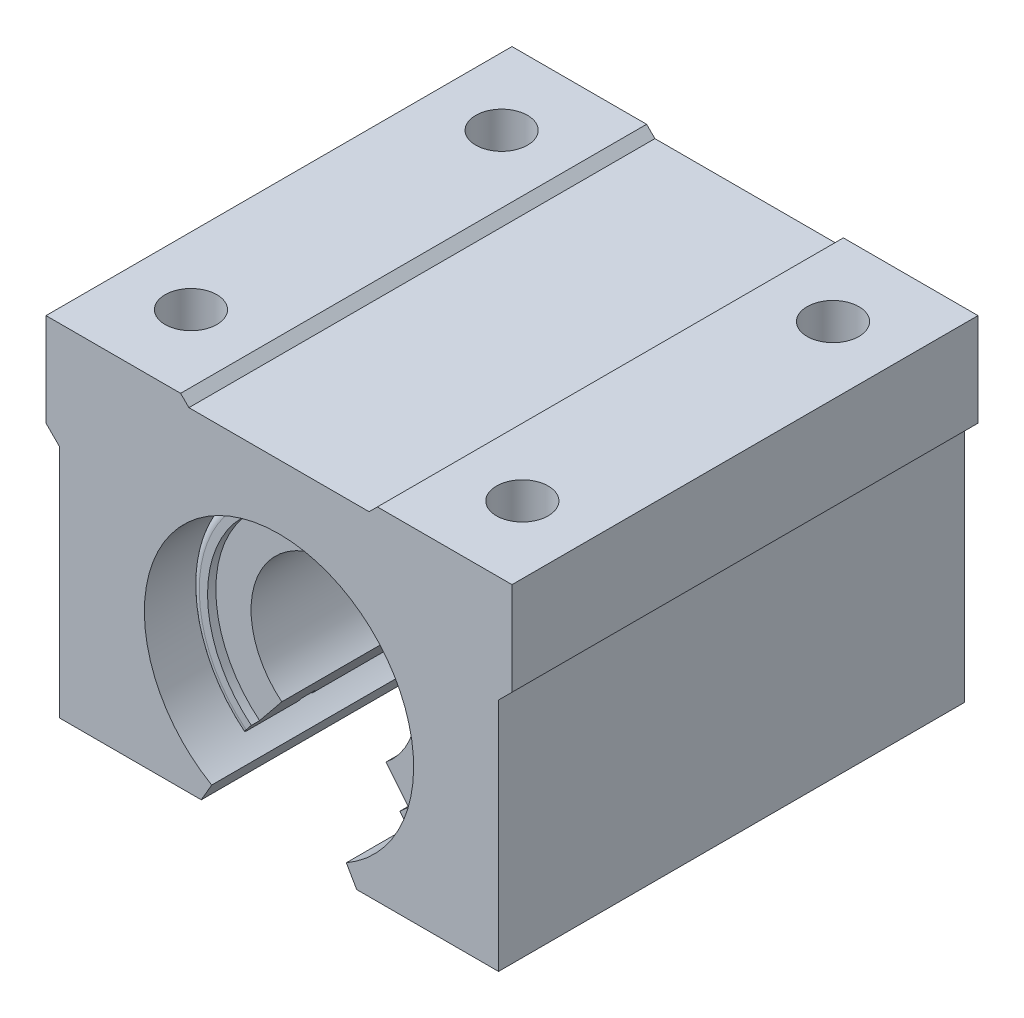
ISO-10303-21;
HEADER;
FILE_DESCRIPTION(('STEP AP214'),'2;1');
FILE_NAME('part.step','',(''),(''),'','','');
FILE_SCHEMA(('AUTOMOTIVE_DESIGN { 1 0 10303 214 1 1 1 1 }'));
ENDSEC;
DATA;
#1=APPLICATION_CONTEXT('core data for automotive mechanical design processes');
#2=APPLICATION_PROTOCOL_DEFINITION('international standard','automotive_design',2000,#1);
#3=PRODUCT_CONTEXT('',#1,'mechanical');
#4=PRODUCT('Part','Part','',(#3));
#5=PRODUCT_RELATED_PRODUCT_CATEGORY('part','',(#4));
#6=PRODUCT_DEFINITION_FORMATION('','',#4);
#7=PRODUCT_DEFINITION_CONTEXT('part definition',#1,'design');
#8=PRODUCT_DEFINITION('design','',#6,#7);
#9=PRODUCT_DEFINITION_SHAPE('','',#8);
#10=(LENGTH_UNIT() NAMED_UNIT(*) SI_UNIT(.MILLI.,.METRE.));
#11=(NAMED_UNIT(*) PLANE_ANGLE_UNIT() SI_UNIT($,.RADIAN.));
#12=(NAMED_UNIT(*) SI_UNIT($,.STERADIAN.) SOLID_ANGLE_UNIT());
#13=UNCERTAINTY_MEASURE_WITH_UNIT(LENGTH_MEASURE(1.E-05),#10,'distance_accuracy_value','');
#14=(GEOMETRIC_REPRESENTATION_CONTEXT(3) GLOBAL_UNCERTAINTY_ASSIGNED_CONTEXT((#13)) GLOBAL_UNIT_ASSIGNED_CONTEXT((#10,
#11,#12)) REPRESENTATION_CONTEXT('',''));
#15=CARTESIAN_POINT('',(0.,0.,0.));
#16=DIRECTION('',(0.,0.,1.));
#17=DIRECTION('',(1.,0.,0.));
#18=AXIS2_PLACEMENT_3D('',#15,#16,#17);
#19=CARTESIAN_POINT('',(0.,0.,18.));
#20=DIRECTION('',(0.,0.,-1.));
#21=DIRECTION('',(-1.,0.,0.));
#22=AXIS2_PLACEMENT_3D('',#19,#20,#21);
#23=CYLINDRICAL_SURFACE('',#22,8.);
#24=DIRECTION('',(0.,0.,-1.));
#25=VECTOR('',#24,1.);
#26=CARTESIAN_POINT('',(5.03456312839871,-6.21716769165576,18.));
#27=LINE('',#26,#25);
#28=CARTESIAN_POINT('',(5.03456312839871,-6.21716769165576,17.2));
#29=VERTEX_POINT('',#28);
#30=CARTESIAN_POINT('',(5.03456312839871,-6.21716769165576,-17.2));
#31=VERTEX_POINT('',#30);
#32=EDGE_CURVE('P0_E38',#29,#31,#27,.T.);
#33=ORIENTED_EDGE('',*,*,#32,.F.);
#34=CARTESIAN_POINT('',(0.,0.,17.2));
#35=DIRECTION('',(0.,0.,1.));
#36=DIRECTION('',(1.,0.,0.));
#37=AXIS2_PLACEMENT_3D('',#34,#35,#36);
#38=CIRCLE('',#37,8.);
#39=CARTESIAN_POINT('',(-5.03456312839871,-6.21716769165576,17.2));
#40=VERTEX_POINT('',#39);
#41=EDGE_CURVE('P0_E168',#29,#40,#38,.T.);
#42=ORIENTED_EDGE('',*,*,#41,.T.);
#43=DIRECTION('',(0.,0.,-1.));
#44=VECTOR('',#43,1.);
#45=CARTESIAN_POINT('',(-5.03456312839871,-6.21716769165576,18.));
#46=LINE('',#45,#44);
#47=CARTESIAN_POINT('',(-5.03456312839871,-6.21716769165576,-17.2));
#48=VERTEX_POINT('',#47);
#49=EDGE_CURVE('P0_E211',#48,#40,#46,.F.);
#50=ORIENTED_EDGE('',*,*,#49,.F.);
#51=CARTESIAN_POINT('',(0.,0.,-17.2));
#52=DIRECTION('',(0.,0.,-1.));
#53=DIRECTION('',(-1.,0.,0.));
#54=AXIS2_PLACEMENT_3D('',#51,#52,#53);
#55=CIRCLE('',#54,8.);
#56=EDGE_CURVE('P0_E166',#48,#31,#55,.T.);
#57=ORIENTED_EDGE('',*,*,#56,.T.);
#58=EDGE_LOOP('',(#33,#42,#50,#57));
#59=FACE_BOUND('',#58,.T.);
#60=ADVANCED_FACE('P0_F16',(#59),#23,.F.);
#61=CARTESIAN_POINT('',(0.,0.,-18.));
#62=DIRECTION('',(0.,0.,1.));
#63=DIRECTION('',(1.,0.,0.));
#64=AXIS2_PLACEMENT_3D('',#61,#62,#63);
#65=PLANE('',#64);
#66=CARTESIAN_POINT('',(0.,0.,-18.));
#67=DIRECTION('',(0.,0.,1.));
#68=DIRECTION('',(1.,0.,0.));
#69=AXIS2_PLACEMENT_3D('',#66,#67,#68);
#70=CIRCLE('',#69,12.2);
#71=CARTESIAN_POINT('',(-7.67770877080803,-9.48118072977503,-18.));
#72=VERTEX_POINT('',#71);
#73=CARTESIAN_POINT('',(7.67770877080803,-9.48118072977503,-18.));
#74=VERTEX_POINT('',#73);
#75=EDGE_CURVE('P0_E202',#72,#74,#70,.F.);
#76=ORIENTED_EDGE('',*,*,#75,.T.);
#77=DIRECTION('',(-0.629320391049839,0.77714596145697,0.));
#78=VECTOR('',#77,1.);
#79=CARTESIAN_POINT('',(0.,0.,-18.));
#80=LINE('',#79,#78);
#81=CARTESIAN_POINT('',(7.17425245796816,-8.85946396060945,-18.));
#82=VERTEX_POINT('',#81);
#83=EDGE_CURVE('P0_E159',#74,#82,#80,.T.);
#84=ORIENTED_EDGE('',*,*,#83,.T.);
#85=CARTESIAN_POINT('',(0.,0.,-18.));
#86=DIRECTION('',(0.,0.,1.));
#87=DIRECTION('',(1.,0.,0.));
#88=AXIS2_PLACEMENT_3D('',#85,#86,#87);
#89=CIRCLE('',#88,11.4);
#90=CARTESIAN_POINT('',(-7.17425245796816,-8.85946396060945,-18.));
#91=VERTEX_POINT('',#90);
#92=EDGE_CURVE('P0_E228',#82,#91,#89,.T.);
#93=ORIENTED_EDGE('',*,*,#92,.T.);
#94=DIRECTION('',(-0.629320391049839,-0.77714596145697,0.));
#95=VECTOR('',#94,1.);
#96=CARTESIAN_POINT('',(0.,0.,-18.));
#97=LINE('',#96,#95);
#98=EDGE_CURVE('P0_E258',#91,#72,#97,.T.);
#99=ORIENTED_EDGE('',*,*,#98,.T.);
#100=EDGE_LOOP('',(#76,#84,#93,#99));
#101=FACE_BOUND('',#100,.T.);
#102=ADVANCED_FACE('P0_F257',(#101),#65,.F.);
#103=CARTESIAN_POINT('',(0.,0.,18.));
#104=DIRECTION('',(0.,0.,-1.));
#105=DIRECTION('',(-1.,0.,0.));
#106=AXIS2_PLACEMENT_3D('',#103,#104,#105);
#107=CYLINDRICAL_SURFACE('',#106,13.);
#108=CARTESIAN_POINT('',(0.,0.,11.15));
#109=DIRECTION('',(0.,0.,1.));
#110=DIRECTION('',(1.,0.,0.));
#111=AXIS2_PLACEMENT_3D('',#108,#109,#110);
#112=CIRCLE('',#111,13.);
#113=CARTESIAN_POINT('',(8.1811650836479,-10.1028974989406,11.15));
#114=VERTEX_POINT('',#113);
#115=CARTESIAN_POINT('',(-8.1811650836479,-10.1028974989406,11.15));
#116=VERTEX_POINT('',#115);
#117=EDGE_CURVE('P0_E187',#114,#116,#112,.T.);
#118=ORIENTED_EDGE('',*,*,#117,.F.);
#119=DIRECTION('',(0.,0.,1.));
#120=VECTOR('',#119,1.);
#121=CARTESIAN_POINT('',(8.1811650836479,-10.1028974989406,-18.));
#122=LINE('',#121,#120);
#123=CARTESIAN_POINT('',(8.1811650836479,-10.1028974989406,-11.15));
#124=VERTEX_POINT('',#123);
#125=EDGE_CURVE('P0_E268',#124,#114,#122,.T.);
#126=ORIENTED_EDGE('',*,*,#125,.F.);
#127=CARTESIAN_POINT('',(0.,0.,-11.15));
#128=DIRECTION('',(0.,0.,1.));
#129=DIRECTION('',(1.,0.,0.));
#130=AXIS2_PLACEMENT_3D('',#127,#128,#129);
#131=CIRCLE('',#130,13.);
#132=CARTESIAN_POINT('',(-8.1811650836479,-10.1028974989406,-11.15));
#133=VERTEX_POINT('',#132);
#134=EDGE_CURVE('P0_E184',#124,#133,#131,.T.);
#135=ORIENTED_EDGE('',*,*,#134,.T.);
#136=DIRECTION('',(0.,0.,1.));
#137=VECTOR('',#136,1.);
#138=CARTESIAN_POINT('',(-8.1811650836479,-10.1028974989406,-18.));
#139=LINE('',#138,#137);
#140=EDGE_CURVE('P0_E273',#133,#116,#139,.T.);
#141=ORIENTED_EDGE('',*,*,#140,.T.);
#142=EDGE_LOOP('',(#118,#126,#135,#141));
#143=FACE_BOUND('',#142,.T.);
#144=ADVANCED_FACE('P0_F325',(#143),#107,.T.);
#145=CARTESIAN_POINT('',(0.,0.,-12.45));
#146=DIRECTION('',(0.,0.,1.));
#147=DIRECTION('',(1.,0.,0.));
#148=AXIS2_PLACEMENT_3D('',#145,#146,#147);
#149=CIRCLE('',#148,13.);
#150=CARTESIAN_POINT('',(8.1811650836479,-10.1028974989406,-12.45));
#151=VERTEX_POINT('',#150);
#152=CARTESIAN_POINT('',(-8.1811650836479,-10.1028974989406,-12.45));
#153=VERTEX_POINT('',#152);
#154=EDGE_CURVE('P0_E181',#151,#153,#149,.T.);
#155=ORIENTED_EDGE('',*,*,#154,.F.);
#156=CARTESIAN_POINT('',(8.1811650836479,-10.1028974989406,-17.2));
#157=VERTEX_POINT('',#156);
#158=EDGE_CURVE('P0_E270',#157,#151,#122,.T.);
#159=ORIENTED_EDGE('',*,*,#158,.F.);
#160=CARTESIAN_POINT('',(0.,0.,-17.2));
#161=DIRECTION('',(0.,0.,1.));
#162=DIRECTION('',(1.,0.,0.));
#163=AXIS2_PLACEMENT_3D('',#160,#161,#162);
#164=CIRCLE('',#163,13.);
#165=CARTESIAN_POINT('',(-8.1811650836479,-10.1028974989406,-17.2));
#166=VERTEX_POINT('',#165);
#167=EDGE_CURVE('P0_E199',#157,#166,#164,.T.);
#168=ORIENTED_EDGE('',*,*,#167,.T.);
#169=EDGE_CURVE('P0_E269',#166,#153,#139,.T.);
#170=ORIENTED_EDGE('',*,*,#169,.T.);
#171=EDGE_LOOP('',(#155,#159,#168,#170));
#172=FACE_BOUND('',#171,.T.);
#173=ADVANCED_FACE('P0_F333',(#172),#107,.T.);
#174=CARTESIAN_POINT('',(0.,0.,17.2));
#175=DIRECTION('',(0.,0.,1.));
#176=DIRECTION('',(1.,0.,0.));
#177=AXIS2_PLACEMENT_3D('',#174,#175,#176);
#178=CIRCLE('',#177,13.);
#179=CARTESIAN_POINT('',(-8.1811650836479,-10.1028974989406,17.2));
#180=VERTEX_POINT('',#179);
#181=CARTESIAN_POINT('',(8.1811650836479,-10.1028974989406,17.2));
#182=VERTEX_POINT('',#181);
#183=EDGE_CURVE('P0_E206',#180,#182,#178,.F.);
#184=ORIENTED_EDGE('',*,*,#183,.T.);
#185=CARTESIAN_POINT('',(8.1811650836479,-10.1028974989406,12.45));
#186=VERTEX_POINT('',#185);
#187=EDGE_CURVE('P0_E266',#186,#182,#122,.T.);
#188=ORIENTED_EDGE('',*,*,#187,.F.);
#189=CARTESIAN_POINT('',(0.,0.,12.45));
#190=DIRECTION('',(0.,0.,1.));
#191=DIRECTION('',(1.,0.,0.));
#192=AXIS2_PLACEMENT_3D('',#189,#190,#191);
#193=CIRCLE('',#192,13.);
#194=CARTESIAN_POINT('',(-8.1811650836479,-10.1028974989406,12.45));
#195=VERTEX_POINT('',#194);
#196=EDGE_CURVE('P0_E196',#186,#195,#193,.T.);
#197=ORIENTED_EDGE('',*,*,#196,.T.);
#198=EDGE_CURVE('P0_E262',#195,#180,#139,.T.);
#199=ORIENTED_EDGE('',*,*,#198,.T.);
#200=EDGE_LOOP('',(#184,#188,#197,#199));
#201=FACE_BOUND('',#200,.T.);
#202=ADVANCED_FACE('P0_F305',(#201),#107,.T.);
#203=CARTESIAN_POINT('',(0.,0.,18.));
#204=DIRECTION('',(0.,0.,1.));
#205=DIRECTION('',(1.,0.,0.));
#206=AXIS2_PLACEMENT_3D('',#203,#204,#205);
#207=PLANE('',#206);
#208=DIRECTION('',(-0.629320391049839,0.77714596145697,0.));
#209=VECTOR('',#208,1.);
#210=CARTESIAN_POINT('',(0.,0.,18.));
#211=LINE('',#210,#209);
#212=CARTESIAN_POINT('',(7.67770877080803,-9.48118072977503,18.));
#213=VERTEX_POINT('',#212);
#214=CARTESIAN_POINT('',(7.17425245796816,-8.85946396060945,18.));
#215=VERTEX_POINT('',#214);
#216=EDGE_CURVE('P0_E160',#213,#215,#211,.T.);
#217=ORIENTED_EDGE('',*,*,#216,.F.);
#218=CARTESIAN_POINT('',(0.,0.,18.));
#219=DIRECTION('',(0.,0.,1.));
#220=DIRECTION('',(1.,0.,0.));
#221=AXIS2_PLACEMENT_3D('',#218,#219,#220);
#222=CIRCLE('',#221,12.2);
#223=CARTESIAN_POINT('',(-7.67770877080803,-9.48118072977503,18.));
#224=VERTEX_POINT('',#223);
#225=EDGE_CURVE('P0_E158',#213,#224,#222,.T.);
#226=ORIENTED_EDGE('',*,*,#225,.T.);
#227=DIRECTION('',(-0.629320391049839,-0.77714596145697,0.));
#228=VECTOR('',#227,1.);
#229=CARTESIAN_POINT('',(0.,0.,18.));
#230=LINE('',#229,#228);
#231=CARTESIAN_POINT('',(-7.17425245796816,-8.85946396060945,18.));
#232=VERTEX_POINT('',#231);
#233=EDGE_CURVE('P0_E141',#232,#224,#230,.T.);
#234=ORIENTED_EDGE('',*,*,#233,.F.);
#235=CARTESIAN_POINT('',(0.,0.,18.));
#236=DIRECTION('',(0.,0.,1.));
#237=DIRECTION('',(1.,0.,0.));
#238=AXIS2_PLACEMENT_3D('',#235,#236,#237);
#239=CIRCLE('',#238,11.4);
#240=EDGE_CURVE('P0_E156',#215,#232,#239,.T.);
#241=ORIENTED_EDGE('',*,*,#240,.F.);
#242=EDGE_LOOP('',(#217,#226,#234,#241));
#243=FACE_BOUND('',#242,.T.);
#244=ADVANCED_FACE('P0_F155',(#243),#207,.T.);
#245=CARTESIAN_POINT('',(0.,-13.,12.45));
#246=DIRECTION('',(0.,0.,-1.));
#247=DIRECTION('',(-1.,0.,0.));
#248=AXIS2_PLACEMENT_3D('',#245,#246,#247);
#249=PLANE('',#248);
#250=DIRECTION('',(0.629320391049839,-0.77714596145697,0.));
#251=VECTOR('',#250,1.);
#252=CARTESIAN_POINT('',(6.35795940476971,-7.85142599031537,12.45));
#253=LINE('',#252,#251);
#254=CARTESIAN_POINT('',(7.83503886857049,-9.67546722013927,12.45));
#255=VERTEX_POINT('',#254);
#256=EDGE_CURVE('P0_E253',#255,#186,#253,.T.);
#257=ORIENTED_EDGE('',*,*,#256,.F.);
#258=CARTESIAN_POINT('',(0.,0.,12.45));
#259=DIRECTION('',(0.,0.,1.));
#260=DIRECTION('',(1.,0.,0.));
#261=AXIS2_PLACEMENT_3D('',#258,#259,#260);
#262=CIRCLE('',#261,12.45);
#263=CARTESIAN_POINT('',(-7.83503886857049,-9.67546722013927,12.45));
#264=VERTEX_POINT('',#263);
#265=EDGE_CURVE('P0_E193',#255,#264,#262,.T.);
#266=ORIENTED_EDGE('',*,*,#265,.T.);
#267=DIRECTION('',(0.629320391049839,0.77714596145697,0.));
#268=VECTOR('',#267,1.);
#269=CARTESIAN_POINT('',(-6.35795940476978,-7.85142599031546,12.45));
#270=LINE('',#269,#268);
#271=EDGE_CURVE('P0_E229',#195,#264,#270,.T.);
#272=ORIENTED_EDGE('',*,*,#271,.F.);
#273=ORIENTED_EDGE('',*,*,#196,.F.);
#274=EDGE_LOOP('',(#257,#266,#272,#273));
#275=FACE_BOUND('',#274,.T.);
#276=ADVANCED_FACE('P0_F303',(#275),#249,.T.);
#277=CARTESIAN_POINT('',(0.,0.,0.));
#278=DIRECTION('',(0.,0.,1.));
#279=DIRECTION('',(1.,0.,0.));
#280=AXIS2_PLACEMENT_3D('',#277,#278,#279);
#281=CYLINDRICAL_SURFACE('',#280,12.45);
#282=DIRECTION('',(0.,0.,1.));
#283=VECTOR('',#282,1.);
#284=CARTESIAN_POINT('',(7.83503886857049,-9.67546722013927,0.));
#285=LINE('',#284,#283);
#286=CARTESIAN_POINT('',(7.83503886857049,-9.67546722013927,11.15));
#287=VERTEX_POINT('',#286);
#288=EDGE_CURVE('P0_E251',#287,#255,#285,.T.);
#289=ORIENTED_EDGE('',*,*,#288,.F.);
#290=CARTESIAN_POINT('',(0.,0.,11.15));
#291=DIRECTION('',(0.,0.,1.));
#292=DIRECTION('',(1.,0.,0.));
#293=AXIS2_PLACEMENT_3D('',#290,#291,#292);
#294=CIRCLE('',#293,12.45);
#295=CARTESIAN_POINT('',(-7.83503886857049,-9.67546722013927,11.15));
#296=VERTEX_POINT('',#295);
#297=EDGE_CURVE('P0_E190',#287,#296,#294,.T.);
#298=ORIENTED_EDGE('',*,*,#297,.T.);
#299=DIRECTION('',(0.,0.,1.));
#300=VECTOR('',#299,1.);
#301=CARTESIAN_POINT('',(-7.83503886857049,-9.67546722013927,0.));
#302=LINE('',#301,#300);
#303=EDGE_CURVE('P0_E233',#264,#296,#302,.F.);
#304=ORIENTED_EDGE('',*,*,#303,.F.);
#305=ORIENTED_EDGE('',*,*,#265,.F.);
#306=EDGE_LOOP('',(#289,#298,#304,#305));
#307=FACE_BOUND('',#306,.T.);
#308=ADVANCED_FACE('P0_F298',(#307),#281,.T.);
#309=CARTESIAN_POINT('',(0.,-12.45,11.15));
#310=DIRECTION('',(0.,0.,1.));
#311=DIRECTION('',(1.,0.,0.));
#312=AXIS2_PLACEMENT_3D('',#309,#310,#311);
#313=PLANE('',#312);
#314=DIRECTION('',(-0.629320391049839,0.77714596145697,0.));
#315=VECTOR('',#314,1.);
#316=CARTESIAN_POINT('',(6.08896881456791,-7.51925027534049,11.15));
#317=LINE('',#316,#315);
#318=EDGE_CURVE('P0_E249',#114,#287,#317,.T.);
#319=ORIENTED_EDGE('',*,*,#318,.F.);
#320=ORIENTED_EDGE('',*,*,#117,.T.);
#321=DIRECTION('',(-0.629320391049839,-0.77714596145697,0.));
#322=VECTOR('',#321,1.);
#323=CARTESIAN_POINT('',(-6.08896881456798,-7.51925027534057,11.15));
#324=LINE('',#323,#322);
#325=EDGE_CURVE('P0_E285',#296,#116,#324,.T.);
#326=ORIENTED_EDGE('',*,*,#325,.F.);
#327=ORIENTED_EDGE('',*,*,#297,.F.);
#328=EDGE_LOOP('',(#319,#320,#326,#327));
#329=FACE_BOUND('',#328,.T.);
#330=ADVANCED_FACE('P0_F295',(#329),#313,.T.);
#331=CARTESIAN_POINT('',(0.,-12.45,-11.15));
#332=DIRECTION('',(0.,0.,-1.));
#333=DIRECTION('',(-1.,0.,0.));
#334=AXIS2_PLACEMENT_3D('',#331,#332,#333);
#335=PLANE('',#334);
#336=DIRECTION('',(0.629320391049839,-0.77714596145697,0.));
#337=VECTOR('',#336,1.);
#338=CARTESIAN_POINT('',(6.08896881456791,-7.51925027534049,-11.15));
#339=LINE('',#338,#337);
#340=CARTESIAN_POINT('',(7.83503886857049,-9.67546722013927,-11.15));
#341=VERTEX_POINT('',#340);
#342=EDGE_CURVE('P0_E247',#341,#124,#339,.T.);
#343=ORIENTED_EDGE('',*,*,#342,.F.);
#344=CARTESIAN_POINT('',(0.,0.,-11.15));
#345=DIRECTION('',(0.,0.,1.));
#346=DIRECTION('',(1.,0.,0.));
#347=AXIS2_PLACEMENT_3D('',#344,#345,#346);
#348=CIRCLE('',#347,12.45);
#349=CARTESIAN_POINT('',(-7.83503886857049,-9.67546722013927,-11.15));
#350=VERTEX_POINT('',#349);
#351=EDGE_CURVE('P0_E175',#341,#350,#348,.T.);
#352=ORIENTED_EDGE('',*,*,#351,.T.);
#353=DIRECTION('',(0.629320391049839,0.77714596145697,0.));
#354=VECTOR('',#353,1.);
#355=CARTESIAN_POINT('',(-6.08896881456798,-7.51925027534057,-11.15));
#356=LINE('',#355,#354);
#357=EDGE_CURVE('P0_E283',#133,#350,#356,.T.);
#358=ORIENTED_EDGE('',*,*,#357,.F.);
#359=ORIENTED_EDGE('',*,*,#134,.F.);
#360=EDGE_LOOP('',(#343,#352,#358,#359));
#361=FACE_BOUND('',#360,.T.);
#362=ADVANCED_FACE('P0_F361',(#361),#335,.T.);
#363=CARTESIAN_POINT('',(0.,-13.,-12.45));
#364=DIRECTION('',(0.,0.,1.));
#365=DIRECTION('',(1.,0.,0.));
#366=AXIS2_PLACEMENT_3D('',#363,#364,#365);
#367=PLANE('',#366);
#368=DIRECTION('',(-0.629320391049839,0.77714596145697,0.));
#369=VECTOR('',#368,1.);
#370=CARTESIAN_POINT('',(6.35795940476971,-7.85142599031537,-12.45));
#371=LINE('',#370,#369);
#372=CARTESIAN_POINT('',(7.83503886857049,-9.67546722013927,-12.45));
#373=VERTEX_POINT('',#372);
#374=EDGE_CURVE('P0_E245',#151,#373,#371,.T.);
#375=ORIENTED_EDGE('',*,*,#374,.F.);
#376=ORIENTED_EDGE('',*,*,#154,.T.);
#377=DIRECTION('',(-0.629320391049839,-0.77714596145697,0.));
#378=VECTOR('',#377,1.);
#379=CARTESIAN_POINT('',(-6.35795940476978,-7.85142599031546,-12.45));
#380=LINE('',#379,#378);
#381=CARTESIAN_POINT('',(-7.83503886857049,-9.67546722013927,-12.45));
#382=VERTEX_POINT('',#381);
#383=EDGE_CURVE('P0_E281',#382,#153,#380,.T.);
#384=ORIENTED_EDGE('',*,*,#383,.F.);
#385=CARTESIAN_POINT('',(0.,0.,-12.45));
#386=DIRECTION('',(0.,0.,1.));
#387=DIRECTION('',(1.,0.,0.));
#388=AXIS2_PLACEMENT_3D('',#385,#386,#387);
#389=CIRCLE('',#388,12.45);
#390=EDGE_CURVE('P0_E178',#373,#382,#389,.T.);
#391=ORIENTED_EDGE('',*,*,#390,.F.);
#392=EDGE_LOOP('',(#375,#376,#384,#391));
#393=FACE_BOUND('',#392,.T.);
#394=ADVANCED_FACE('P0_F353',(#393),#367,.T.);
#395=CARTESIAN_POINT('',(0.,0.,0.));
#396=DIRECTION('',(0.,0.,1.));
#397=DIRECTION('',(1.,0.,0.));
#398=AXIS2_PLACEMENT_3D('',#395,#396,#397);
#399=CYLINDRICAL_SURFACE('',#398,12.45);
#400=DIRECTION('',(0.,0.,1.));
#401=VECTOR('',#400,1.);
#402=CARTESIAN_POINT('',(7.83503886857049,-9.67546722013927,0.));
#403=LINE('',#402,#401);
#404=EDGE_CURVE('P0_E243',#373,#341,#403,.T.);
#405=ORIENTED_EDGE('',*,*,#404,.F.);
#406=ORIENTED_EDGE('',*,*,#390,.T.);
#407=DIRECTION('',(0.,0.,1.));
#408=VECTOR('',#407,1.);
#409=CARTESIAN_POINT('',(-7.83503886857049,-9.67546722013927,0.));
#410=LINE('',#409,#408);
#411=EDGE_CURVE('P0_E279',#350,#382,#410,.F.);
#412=ORIENTED_EDGE('',*,*,#411,.F.);
#413=ORIENTED_EDGE('',*,*,#351,.F.);
#414=EDGE_LOOP('',(#405,#406,#412,#413));
#415=FACE_BOUND('',#414,.T.);
#416=ADVANCED_FACE('P0_F318',(#415),#399,.T.);
#417=CARTESIAN_POINT('',(0.,0.,-17.2));
#418=DIRECTION('',(0.,0.,1.));
#419=DIRECTION('',(1.,0.,0.));
#420=AXIS2_PLACEMENT_3D('',#417,#418,#419);
#421=TOROIDAL_SURFACE('',#420,12.2,0.8);
#422=CARTESIAN_POINT('',(7.67770877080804,-9.48118072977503,-17.2));
#423=DIRECTION('',(0.77714596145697,0.629320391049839,0.));
#424=DIRECTION('',(-0.629320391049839,0.77714596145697,0.));
#425=AXIS2_PLACEMENT_3D('',#422,#423,#424);
#426=CIRCLE('',#425,0.8);
#427=EDGE_CURVE('P0_E241',#74,#157,#426,.F.);
#428=ORIENTED_EDGE('',*,*,#427,.F.);
#429=ORIENTED_EDGE('',*,*,#75,.F.);
#430=CARTESIAN_POINT('',(-7.67770877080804,-9.48118072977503,-17.2));
#431=DIRECTION('',(-0.77714596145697,0.629320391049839,0.));
#432=DIRECTION('',(-0.629320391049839,-0.77714596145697,0.));
#433=AXIS2_PLACEMENT_3D('',#430,#431,#432);
#434=CIRCLE('',#433,0.8);
#435=EDGE_CURVE('P0_E277',#166,#72,#434,.F.);
#436=ORIENTED_EDGE('',*,*,#435,.F.);
#437=ORIENTED_EDGE('',*,*,#167,.F.);
#438=EDGE_LOOP('',(#428,#429,#436,#437));
#439=FACE_BOUND('',#438,.T.);
#440=ADVANCED_FACE('P0_F310',(#439),#421,.T.);
#441=CARTESIAN_POINT('',(0.,0.,17.2));
#442=DIRECTION('',(0.,0.,1.));
#443=DIRECTION('',(1.,0.,0.));
#444=AXIS2_PLACEMENT_3D('',#441,#442,#443);
#445=TOROIDAL_SURFACE('',#444,12.2,0.8);
#446=CARTESIAN_POINT('',(7.67770877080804,-9.48118072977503,17.2));
#447=DIRECTION('',(0.77714596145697,0.629320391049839,0.));
#448=DIRECTION('',(-0.629320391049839,0.77714596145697,0.));
#449=AXIS2_PLACEMENT_3D('',#446,#447,#448);
#450=CIRCLE('',#449,0.8);
#451=EDGE_CURVE('P0_E239',#182,#213,#450,.F.);
#452=ORIENTED_EDGE('',*,*,#451,.F.);
#453=ORIENTED_EDGE('',*,*,#183,.F.);
#454=CARTESIAN_POINT('',(-7.67770877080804,-9.48118072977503,17.2));
#455=DIRECTION('',(-0.77714596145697,0.629320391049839,0.));
#456=DIRECTION('',(-0.629320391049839,-0.77714596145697,0.));
#457=AXIS2_PLACEMENT_3D('',#454,#455,#456);
#458=CIRCLE('',#457,0.8);
#459=EDGE_CURVE('P0_E149',#224,#180,#458,.F.);
#460=ORIENTED_EDGE('',*,*,#459,.F.);
#461=ORIENTED_EDGE('',*,*,#225,.F.);
#462=EDGE_LOOP('',(#452,#453,#460,#461));
#463=FACE_BOUND('',#462,.T.);
#464=ADVANCED_FACE('P0_F18',(#463),#445,.T.);
#465=CARTESIAN_POINT('',(0.,0.,17.2));
#466=DIRECTION('',(0.,0.,1.));
#467=DIRECTION('',(1.,0.,0.));
#468=AXIS2_PLACEMENT_3D('',#465,#466,#467);
#469=CYLINDRICAL_SURFACE('',#468,11.4);
#470=CARTESIAN_POINT('',(0.,0.,17.2));
#471=DIRECTION('',(0.,0.,1.));
#472=DIRECTION('',(1.,0.,0.));
#473=AXIS2_PLACEMENT_3D('',#470,#471,#472);
#474=CIRCLE('',#473,11.4);
#475=CARTESIAN_POINT('',(7.17425245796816,-8.85946396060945,17.2));
#476=VERTEX_POINT('',#475);
#477=CARTESIAN_POINT('',(-7.17425245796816,-8.85946396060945,17.2));
#478=VERTEX_POINT('',#477);
#479=EDGE_CURVE('P0_E165',#476,#478,#474,.T.);
#480=ORIENTED_EDGE('',*,*,#479,.F.);
#481=DIRECTION('',(0.,0.,1.));
#482=VECTOR('',#481,1.);
#483=CARTESIAN_POINT('',(7.17425245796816,-8.85946396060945,17.2));
#484=LINE('',#483,#482);
#485=EDGE_CURVE('P0_E164',#476,#215,#484,.T.);
#486=ORIENTED_EDGE('',*,*,#485,.T.);
#487=ORIENTED_EDGE('',*,*,#240,.T.);
#488=DIRECTION('',(0.,0.,1.));
#489=VECTOR('',#488,1.);
#490=CARTESIAN_POINT('',(-7.17425245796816,-8.85946396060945,17.2));
#491=LINE('',#490,#489);
#492=EDGE_CURVE('P0_E138',#232,#478,#491,.F.);
#493=ORIENTED_EDGE('',*,*,#492,.T.);
#494=EDGE_LOOP('',(#480,#486,#487,#493));
#495=FACE_BOUND('',#494,.T.);
#496=ADVANCED_FACE('P0_F163',(#495),#469,.F.);
#497=CARTESIAN_POINT('',(0.,0.,17.2));
#498=DIRECTION('',(0.,0.,1.));
#499=DIRECTION('',(1.,0.,0.));
#500=AXIS2_PLACEMENT_3D('',#497,#498,#499);
#501=PLANE('',#500);
#502=DIRECTION('',(-0.629320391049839,0.77714596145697,0.));
#503=VECTOR('',#502,1.);
#504=CARTESIAN_POINT('',(0.,0.,17.2));
#505=LINE('',#504,#503);
#506=EDGE_CURVE('P0_E231',#476,#29,#505,.T.);
#507=ORIENTED_EDGE('',*,*,#506,.F.);
#508=ORIENTED_EDGE('',*,*,#479,.T.);
#509=DIRECTION('',(-0.629320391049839,-0.77714596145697,0.));
#510=VECTOR('',#509,1.);
#511=CARTESIAN_POINT('',(0.,0.,17.2));
#512=LINE('',#511,#510);
#513=EDGE_CURVE('P0_E144',#40,#478,#512,.T.);
#514=ORIENTED_EDGE('',*,*,#513,.F.);
#515=ORIENTED_EDGE('',*,*,#41,.F.);
#516=EDGE_LOOP('',(#507,#508,#514,#515));
#517=FACE_BOUND('',#516,.T.);
#518=ADVANCED_FACE('P0_F316',(#517),#501,.T.);
#519=CARTESIAN_POINT('',(0.,0.,-17.2));
#520=DIRECTION('',(0.,0.,-1.));
#521=DIRECTION('',(-1.,0.,0.));
#522=AXIS2_PLACEMENT_3D('',#519,#520,#521);
#523=CYLINDRICAL_SURFACE('',#522,11.4);
#524=DIRECTION('',(0.,0.,-1.));
#525=VECTOR('',#524,1.);
#526=CARTESIAN_POINT('',(7.17425245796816,-8.85946396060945,-17.2));
#527=LINE('',#526,#525);
#528=CARTESIAN_POINT('',(7.17425245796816,-8.85946396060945,-17.2));
#529=VERTEX_POINT('',#528);
#530=EDGE_CURVE('P0_E222',#529,#82,#527,.T.);
#531=ORIENTED_EDGE('',*,*,#530,.F.);
#532=CARTESIAN_POINT('',(0.,0.,-17.2));
#533=DIRECTION('',(0.,0.,1.));
#534=DIRECTION('',(1.,0.,0.));
#535=AXIS2_PLACEMENT_3D('',#532,#533,#534);
#536=CIRCLE('',#535,11.4);
#537=CARTESIAN_POINT('',(-7.17425245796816,-8.85946396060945,-17.2));
#538=VERTEX_POINT('',#537);
#539=EDGE_CURVE('P0_E171',#529,#538,#536,.T.);
#540=ORIENTED_EDGE('',*,*,#539,.T.);
#541=DIRECTION('',(0.,0.,-1.));
#542=VECTOR('',#541,1.);
#543=CARTESIAN_POINT('',(-7.17425245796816,-8.85946396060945,-17.2));
#544=LINE('',#543,#542);
#545=EDGE_CURVE('P0_E31',#91,#538,#544,.F.);
#546=ORIENTED_EDGE('',*,*,#545,.F.);
#547=ORIENTED_EDGE('',*,*,#92,.F.);
#548=EDGE_LOOP('',(#531,#540,#546,#547));
#549=FACE_BOUND('',#548,.T.);
#550=ADVANCED_FACE('P0_F226',(#549),#523,.F.);
#551=CARTESIAN_POINT('',(0.,0.,-17.2));
#552=DIRECTION('',(0.,0.,-1.));
#553=DIRECTION('',(1.,0.,0.));
#554=AXIS2_PLACEMENT_3D('',#551,#552,#553);
#555=PLANE('',#554);
#556=DIRECTION('',(0.629320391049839,-0.77714596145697,0.));
#557=VECTOR('',#556,1.);
#558=CARTESIAN_POINT('',(0.,0.,-17.2));
#559=LINE('',#558,#557);
#560=EDGE_CURVE('P0_E11',#31,#529,#559,.T.);
#561=ORIENTED_EDGE('',*,*,#560,.F.);
#562=ORIENTED_EDGE('',*,*,#56,.F.);
#563=DIRECTION('',(0.629320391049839,0.77714596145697,0.));
#564=VECTOR('',#563,1.);
#565=CARTESIAN_POINT('',(0.,0.,-17.2));
#566=LINE('',#565,#564);
#567=EDGE_CURVE('P0_E24',#538,#48,#566,.T.);
#568=ORIENTED_EDGE('',*,*,#567,.F.);
#569=ORIENTED_EDGE('',*,*,#539,.F.);
#570=EDGE_LOOP('',(#561,#562,#568,#569));
#571=FACE_BOUND('',#570,.T.);
#572=ADVANCED_FACE('P0_F219',(#571),#555,.T.);
#573=CARTESIAN_POINT('',(0.,0.,-18.));
#574=DIRECTION('',(-0.77714596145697,0.629320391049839,0.));
#575=DIRECTION('',(-0.629320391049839,-0.77714596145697,0.));
#576=AXIS2_PLACEMENT_3D('',#573,#574,#575);
#577=PLANE('',#576);
#578=ORIENTED_EDGE('',*,*,#271,.T.);
#579=ORIENTED_EDGE('',*,*,#303,.T.);
#580=ORIENTED_EDGE('',*,*,#325,.T.);
#581=ORIENTED_EDGE('',*,*,#140,.F.);
#582=ORIENTED_EDGE('',*,*,#357,.T.);
#583=ORIENTED_EDGE('',*,*,#411,.T.);
#584=ORIENTED_EDGE('',*,*,#383,.T.);
#585=ORIENTED_EDGE('',*,*,#169,.F.);
#586=ORIENTED_EDGE('',*,*,#435,.T.);
#587=ORIENTED_EDGE('',*,*,#98,.F.);
#588=ORIENTED_EDGE('',*,*,#545,.T.);
#589=ORIENTED_EDGE('',*,*,#567,.T.);
#590=ORIENTED_EDGE('',*,*,#49,.T.);
#591=ORIENTED_EDGE('',*,*,#513,.T.);
#592=ORIENTED_EDGE('',*,*,#492,.F.);
#593=ORIENTED_EDGE('',*,*,#233,.T.);
#594=ORIENTED_EDGE('',*,*,#459,.T.);
#595=ORIENTED_EDGE('',*,*,#198,.F.);
#596=EDGE_LOOP('',(#578,#579,#580,#581,#582,#583,#584,#585,#586,#587,#588,#589,#590,#591,#592,
#593,#594,#595));
#597=FACE_BOUND('',#596,.T.);
#598=ADVANCED_FACE('P0_F140',(#597),#577,.F.);
#599=CARTESIAN_POINT('',(0.,0.,-18.));
#600=DIRECTION('',(0.77714596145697,0.629320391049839,0.));
#601=DIRECTION('',(-0.629320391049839,0.77714596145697,0.));
#602=AXIS2_PLACEMENT_3D('',#599,#600,#601);
#603=PLANE('',#602);
#604=ORIENTED_EDGE('',*,*,#256,.T.);
#605=ORIENTED_EDGE('',*,*,#187,.T.);
#606=ORIENTED_EDGE('',*,*,#451,.T.);
#607=ORIENTED_EDGE('',*,*,#216,.T.);
#608=ORIENTED_EDGE('',*,*,#485,.F.);
#609=ORIENTED_EDGE('',*,*,#506,.T.);
#610=ORIENTED_EDGE('',*,*,#32,.T.);
#611=ORIENTED_EDGE('',*,*,#560,.T.);
#612=ORIENTED_EDGE('',*,*,#530,.T.);
#613=ORIENTED_EDGE('',*,*,#83,.F.);
#614=ORIENTED_EDGE('',*,*,#427,.T.);
#615=ORIENTED_EDGE('',*,*,#158,.T.);
#616=ORIENTED_EDGE('',*,*,#374,.T.);
#617=ORIENTED_EDGE('',*,*,#404,.T.);
#618=ORIENTED_EDGE('',*,*,#342,.T.);
#619=ORIENTED_EDGE('',*,*,#125,.T.);
#620=ORIENTED_EDGE('',*,*,#318,.T.);
#621=ORIENTED_EDGE('',*,*,#288,.T.);
#622=EDGE_LOOP('',(#604,#605,#606,#607,#608,#609,#610,#611,#612,#613,#614,#615,#616,#617,#618,
#619,#620,#621));
#623=FACE_BOUND('',#622,.T.);
#624=ADVANCED_FACE('P0_F221',(#623),#603,.F.);
#625=CLOSED_SHELL('',(#60,#102,#144,#173,#202,#244,#276,#308,#330,#362,#394,#416,#440,#464,#496,
#518,#550,#572,#598,#624));
#626=MANIFOLD_SOLID_BREP('P0_B1',#625);
#627=CARTESIAN_POINT('',(22.5,20.,-22.5));
#628=DIRECTION('',(0.,1.,0.));
#629=DIRECTION('',(-1.,0.,0.));
#630=AXIS2_PLACEMENT_3D('',#627,#628,#629);
#631=PLANE('',#630);
#632=CARTESIAN_POINT('',(-16.,20.,-15.));
#633=DIRECTION('',(0.,1.,0.));
#634=DIRECTION('',(-1.,0.,0.));
#635=AXIS2_PLACEMENT_3D('',#632,#633,#634);
#636=CIRCLE('',#635,2.5);
#637=CARTESIAN_POINT('',(-18.5,20.,-15.));
#638=VERTEX_POINT('',#637);
#639=EDGE_CURVE('P1_E329',#638,#638,#636,.T.);
#640=ORIENTED_EDGE('',*,*,#639,.F.);
#641=EDGE_LOOP('',(#640));
#642=FACE_BOUND('',#641,.T.);
#643=DIRECTION('',(0.,0.,1.));
#644=VECTOR('',#643,1.);
#645=CARTESIAN_POINT('',(-9.5,20.,-22.5));
#646=LINE('',#645,#644);
#647=CARTESIAN_POINT('',(-9.5,20.,-22.5));
#648=VERTEX_POINT('',#647);
#649=CARTESIAN_POINT('',(-9.5,20.,22.5));
#650=VERTEX_POINT('',#649);
#651=EDGE_CURVE('P1_E261',#648,#650,#646,.T.);
#652=ORIENTED_EDGE('',*,*,#651,.F.);
#653=DIRECTION('',(-1.,0.,0.));
#654=VECTOR('',#653,1.);
#655=CARTESIAN_POINT('',(22.5,20.,-22.5));
#656=LINE('',#655,#654);
#657=CARTESIAN_POINT('',(-22.5,20.,-22.5));
#658=VERTEX_POINT('',#657);
#659=EDGE_CURVE('P1_E276',#648,#658,#656,.T.);
#660=ORIENTED_EDGE('',*,*,#659,.T.);
#661=DIRECTION('',(0.,0.,1.));
#662=VECTOR('',#661,1.);
#663=CARTESIAN_POINT('',(-22.5,20.,-22.5));
#664=LINE('',#663,#662);
#665=CARTESIAN_POINT('',(-22.5,20.,22.5));
#666=VERTEX_POINT('',#665);
#667=EDGE_CURVE('P1_E190',#658,#666,#664,.T.);
#668=ORIENTED_EDGE('',*,*,#667,.T.);
#669=DIRECTION('',(-1.,0.,0.));
#670=VECTOR('',#669,1.);
#671=CARTESIAN_POINT('',(22.5,20.,22.5));
#672=LINE('',#671,#670);
#673=EDGE_CURVE('P1_E169',#650,#666,#672,.T.);
#674=ORIENTED_EDGE('',*,*,#673,.F.);
#675=EDGE_LOOP('',(#652,#660,#668,#674));
#676=FACE_BOUND('',#675,.T.);
#677=CARTESIAN_POINT('',(-16.,20.,15.));
#678=DIRECTION('',(0.,1.,0.));
#679=DIRECTION('',(-1.,0.,0.));
#680=AXIS2_PLACEMENT_3D('',#677,#678,#679);
#681=CIRCLE('',#680,2.5);
#682=CARTESIAN_POINT('',(-18.5,20.,15.));
#683=VERTEX_POINT('',#682);
#684=EDGE_CURVE('P1_E292',#683,#683,#681,.T.);
#685=ORIENTED_EDGE('',*,*,#684,.F.);
#686=EDGE_LOOP('',(#685));
#687=FACE_BOUND('',#686,.T.);
#688=ADVANCED_FACE('P1_F15',(#642,#676,#687),#631,.T.);
#689=CARTESIAN_POINT('',(0.,0.,-22.5));
#690=DIRECTION('',(0.,0.,1.));
#691=DIRECTION('',(1.,0.,0.));
#692=AXIS2_PLACEMENT_3D('',#689,#690,#691);
#693=CYLINDRICAL_SURFACE('',#692,13.);
#694=CARTESIAN_POINT('',(0.,0.,22.5));
#695=DIRECTION('',(0.,0.,-1.));
#696=DIRECTION('',(1.,0.,0.));
#697=AXIS2_PLACEMENT_3D('',#694,#695,#696);
#698=CIRCLE('',#697,13.);
#699=CARTESIAN_POINT('',(-6.50000000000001,-11.2583302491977,22.5));
#700=VERTEX_POINT('',#699);
#701=CARTESIAN_POINT('',(6.50000000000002,-11.2583302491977,22.5));
#702=VERTEX_POINT('',#701);
#703=EDGE_CURVE('P1_E150',#700,#702,#698,.T.);
#704=ORIENTED_EDGE('',*,*,#703,.F.);
#705=DIRECTION('',(0.,0.,1.));
#706=VECTOR('',#705,1.);
#707=CARTESIAN_POINT('',(-6.50000000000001,-11.2583302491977,-22.5));
#708=LINE('',#707,#706);
#709=CARTESIAN_POINT('',(-6.50000000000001,-11.2583302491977,-22.5));
#710=VERTEX_POINT('',#709);
#711=EDGE_CURVE('P1_E10',#710,#700,#708,.T.);
#712=ORIENTED_EDGE('',*,*,#711,.F.);
#713=CARTESIAN_POINT('',(0.,0.,-22.5));
#714=DIRECTION('',(0.,0.,-1.));
#715=DIRECTION('',(1.,0.,0.));
#716=AXIS2_PLACEMENT_3D('',#713,#714,#715);
#717=CIRCLE('',#716,13.);
#718=CARTESIAN_POINT('',(6.50000000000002,-11.2583302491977,-22.5));
#719=VERTEX_POINT('',#718);
#720=EDGE_CURVE('P1_E184',#710,#719,#717,.T.);
#721=ORIENTED_EDGE('',*,*,#720,.T.);
#722=DIRECTION('',(0.,0.,1.));
#723=VECTOR('',#722,1.);
#724=CARTESIAN_POINT('',(6.50000000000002,-11.2583302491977,-22.5));
#725=LINE('',#724,#723);
#726=EDGE_CURVE('P1_E19',#719,#702,#725,.T.);
#727=ORIENTED_EDGE('',*,*,#726,.T.);
#728=EDGE_LOOP('',(#704,#712,#721,#727));
#729=FACE_BOUND('',#728,.T.);
#730=ADVANCED_FACE('P1_F17',(#729),#693,.F.);
#731=CARTESIAN_POINT('',(-6.50000000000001,-11.2583302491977,-22.5));
#732=DIRECTION('',(0.866025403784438,-0.500000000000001,0.));
#733=DIRECTION('',(0.500000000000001,0.866025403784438,0.));
#734=AXIS2_PLACEMENT_3D('',#731,#732,#733);
#735=PLANE('',#734);
#736=DIRECTION('',(0.500000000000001,0.866025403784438,0.));
#737=VECTOR('',#736,1.);
#738=CARTESIAN_POINT('',(-6.50000000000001,-11.2583302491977,22.5));
#739=LINE('',#738,#737);
#740=CARTESIAN_POINT('',(-7.50555349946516,-13.,22.5));
#741=VERTEX_POINT('',#740);
#742=EDGE_CURVE('P1_E182',#741,#700,#739,.T.);
#743=ORIENTED_EDGE('',*,*,#742,.F.);
#744=DIRECTION('',(0.,0.,1.));
#745=VECTOR('',#744,1.);
#746=CARTESIAN_POINT('',(-7.50555349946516,-13.,-22.5));
#747=LINE('',#746,#745);
#748=CARTESIAN_POINT('',(-7.50555349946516,-13.,-22.5));
#749=VERTEX_POINT('',#748);
#750=EDGE_CURVE('P1_E24',#749,#741,#747,.T.);
#751=ORIENTED_EDGE('',*,*,#750,.F.);
#752=DIRECTION('',(0.500000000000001,0.866025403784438,0.));
#753=VECTOR('',#752,1.);
#754=CARTESIAN_POINT('',(-6.50000000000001,-11.2583302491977,-22.5));
#755=LINE('',#754,#753);
#756=EDGE_CURVE('P1_E140',#749,#710,#755,.T.);
#757=ORIENTED_EDGE('',*,*,#756,.T.);
#758=ORIENTED_EDGE('',*,*,#711,.T.);
#759=EDGE_LOOP('',(#743,#751,#757,#758));
#760=FACE_BOUND('',#759,.T.);
#761=ADVANCED_FACE('P1_F205',(#760),#735,.T.);
#762=CARTESIAN_POINT('',(-21.2,-13.,-22.5));
#763=DIRECTION('',(0.,-1.,0.));
#764=DIRECTION('',(1.,0.,0.));
#765=AXIS2_PLACEMENT_3D('',#762,#763,#764);
#766=PLANE('',#765);
#767=DIRECTION('',(1.,0.,0.));
#768=VECTOR('',#767,1.);
#769=CARTESIAN_POINT('',(-21.2,-13.,22.5));
#770=LINE('',#769,#768);
#771=CARTESIAN_POINT('',(-21.2,-13.,22.5));
#772=VERTEX_POINT('',#771);
#773=EDGE_CURVE('P1_E126',#772,#741,#770,.T.);
#774=ORIENTED_EDGE('',*,*,#773,.F.);
#775=DIRECTION('',(0.,0.,1.));
#776=VECTOR('',#775,1.);
#777=CARTESIAN_POINT('',(-21.2,-13.,-22.5));
#778=LINE('',#777,#776);
#779=CARTESIAN_POINT('',(-21.2,-13.,-22.5));
#780=VERTEX_POINT('',#779);
#781=EDGE_CURVE('P1_E120',#780,#772,#778,.T.);
#782=ORIENTED_EDGE('',*,*,#781,.F.);
#783=DIRECTION('',(1.,0.,0.));
#784=VECTOR('',#783,1.);
#785=CARTESIAN_POINT('',(-21.2,-13.,-22.5));
#786=LINE('',#785,#784);
#787=EDGE_CURVE('P1_E123',#780,#749,#786,.T.);
#788=ORIENTED_EDGE('',*,*,#787,.T.);
#789=ORIENTED_EDGE('',*,*,#750,.T.);
#790=EDGE_LOOP('',(#774,#782,#788,#789));
#791=FACE_BOUND('',#790,.T.);
#792=ADVANCED_FACE('P1_F122',(#791),#766,.T.);
#793=CARTESIAN_POINT('',(-21.2,9.7,-22.5));
#794=DIRECTION('',(-1.,0.,0.));
#795=DIRECTION('',(0.,-1.,0.));
#796=AXIS2_PLACEMENT_3D('',#793,#794,#795);
#797=PLANE('',#796);
#798=DIRECTION('',(0.,-1.,0.));
#799=VECTOR('',#798,1.);
#800=CARTESIAN_POINT('',(-21.2,9.7,22.5));
#801=LINE('',#800,#799);
#802=CARTESIAN_POINT('',(-21.2,9.7,22.5));
#803=VERTEX_POINT('',#802);
#804=EDGE_CURVE('P1_E179',#803,#772,#801,.T.);
#805=ORIENTED_EDGE('',*,*,#804,.F.);
#806=DIRECTION('',(0.,0.,1.));
#807=VECTOR('',#806,1.);
#808=CARTESIAN_POINT('',(-21.2,9.7,-22.5));
#809=LINE('',#808,#807);
#810=CARTESIAN_POINT('',(-21.2,9.7,-22.5));
#811=VERTEX_POINT('',#810);
#812=EDGE_CURVE('P1_E131',#811,#803,#809,.T.);
#813=ORIENTED_EDGE('',*,*,#812,.F.);
#814=DIRECTION('',(0.,-1.,0.));
#815=VECTOR('',#814,1.);
#816=CARTESIAN_POINT('',(-21.2,9.7,-22.5));
#817=LINE('',#816,#815);
#818=EDGE_CURVE('P1_E138',#811,#780,#817,.T.);
#819=ORIENTED_EDGE('',*,*,#818,.T.);
#820=ORIENTED_EDGE('',*,*,#781,.T.);
#821=EDGE_LOOP('',(#805,#813,#819,#820));
#822=FACE_BOUND('',#821,.T.);
#823=ADVANCED_FACE('P1_F142',(#822),#797,.T.);
#824=CARTESIAN_POINT('',(-22.5,11.,-22.5));
#825=DIRECTION('',(-0.707106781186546,-0.707106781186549,0.));
#826=DIRECTION('',(0.707106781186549,-0.707106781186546,0.));
#827=AXIS2_PLACEMENT_3D('',#824,#825,#826);
#828=PLANE('',#827);
#829=DIRECTION('',(0.707106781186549,-0.707106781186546,0.));
#830=VECTOR('',#829,1.);
#831=CARTESIAN_POINT('',(-22.5,11.,22.5));
#832=LINE('',#831,#830);
#833=CARTESIAN_POINT('',(-22.5,11.,22.5));
#834=VERTEX_POINT('',#833);
#835=EDGE_CURVE('P1_E176',#834,#803,#832,.T.);
#836=ORIENTED_EDGE('',*,*,#835,.F.);
#837=DIRECTION('',(0.,0.,1.));
#838=VECTOR('',#837,1.);
#839=CARTESIAN_POINT('',(-22.5,11.,-22.5));
#840=LINE('',#839,#838);
#841=CARTESIAN_POINT('',(-22.5,11.,-22.5));
#842=VERTEX_POINT('',#841);
#843=EDGE_CURVE('P1_E188',#842,#834,#840,.T.);
#844=ORIENTED_EDGE('',*,*,#843,.F.);
#845=DIRECTION('',(0.707106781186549,-0.707106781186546,0.));
#846=VECTOR('',#845,1.);
#847=CARTESIAN_POINT('',(-22.5,11.,-22.5));
#848=LINE('',#847,#846);
#849=EDGE_CURVE('P1_E143',#842,#811,#848,.T.);
#850=ORIENTED_EDGE('',*,*,#849,.T.);
#851=ORIENTED_EDGE('',*,*,#812,.T.);
#852=EDGE_LOOP('',(#836,#844,#850,#851));
#853=FACE_BOUND('',#852,.T.);
#854=ADVANCED_FACE('P1_F235',(#853),#828,.T.);
#855=CARTESIAN_POINT('',(-22.5,20.,-22.5));
#856=DIRECTION('',(-1.,0.,0.));
#857=DIRECTION('',(0.,-1.,0.));
#858=AXIS2_PLACEMENT_3D('',#855,#856,#857);
#859=PLANE('',#858);
#860=DIRECTION('',(0.,-1.,0.));
#861=VECTOR('',#860,1.);
#862=CARTESIAN_POINT('',(-22.5,20.,22.5));
#863=LINE('',#862,#861);
#864=EDGE_CURVE('P1_E173',#666,#834,#863,.T.);
#865=ORIENTED_EDGE('',*,*,#864,.F.);
#866=ORIENTED_EDGE('',*,*,#667,.F.);
#867=DIRECTION('',(0.,-1.,0.));
#868=VECTOR('',#867,1.);
#869=CARTESIAN_POINT('',(-22.5,20.,-22.5));
#870=LINE('',#869,#868);
#871=EDGE_CURVE('P1_E145',#658,#842,#870,.T.);
#872=ORIENTED_EDGE('',*,*,#871,.T.);
#873=ORIENTED_EDGE('',*,*,#843,.T.);
#874=EDGE_LOOP('',(#865,#866,#872,#873));
#875=FACE_BOUND('',#874,.T.);
#876=ADVANCED_FACE('P1_F227',(#875),#859,.T.);
#877=CARTESIAN_POINT('',(16.,20.,15.));
#878=DIRECTION('',(0.,1.,0.));
#879=DIRECTION('',(-1.,0.,0.));
#880=AXIS2_PLACEMENT_3D('',#877,#878,#879);
#881=CIRCLE('',#880,2.5);
#882=CARTESIAN_POINT('',(13.5,20.,15.));
#883=VERTEX_POINT('',#882);
#884=EDGE_CURVE('P1_E240',#883,#883,#881,.T.);
#885=ORIENTED_EDGE('',*,*,#884,.F.);
#886=EDGE_LOOP('',(#885));
#887=FACE_BOUND('',#886,.T.);
#888=CARTESIAN_POINT('',(16.,20.,-15.));
#889=DIRECTION('',(0.,1.,0.));
#890=DIRECTION('',(-1.,0.,0.));
#891=AXIS2_PLACEMENT_3D('',#888,#889,#890);
#892=CIRCLE('',#891,2.5);
#893=CARTESIAN_POINT('',(13.5,20.,-15.));
#894=VERTEX_POINT('',#893);
#895=EDGE_CURVE('P1_E244',#894,#894,#892,.T.);
#896=ORIENTED_EDGE('',*,*,#895,.F.);
#897=EDGE_LOOP('',(#896));
#898=FACE_BOUND('',#897,.T.);
#899=DIRECTION('',(0.,0.,1.));
#900=VECTOR('',#899,1.);
#901=CARTESIAN_POINT('',(9.5,20.,-22.5));
#902=LINE('',#901,#900);
#903=CARTESIAN_POINT('',(9.5,20.,-22.5));
#904=VERTEX_POINT('',#903);
#905=CARTESIAN_POINT('',(9.5,20.,22.5));
#906=VERTEX_POINT('',#905);
#907=EDGE_CURVE('P1_E250',#904,#906,#902,.T.);
#908=ORIENTED_EDGE('',*,*,#907,.T.);
#909=CARTESIAN_POINT('',(22.5,20.,22.5));
#910=VERTEX_POINT('',#909);
#911=EDGE_CURVE('P1_E170',#910,#906,#672,.T.);
#912=ORIENTED_EDGE('',*,*,#911,.F.);
#913=DIRECTION('',(0.,0.,1.));
#914=VECTOR('',#913,1.);
#915=CARTESIAN_POINT('',(22.5,20.,-22.5));
#916=LINE('',#915,#914);
#917=CARTESIAN_POINT('',(22.5,20.,-22.5));
#918=VERTEX_POINT('',#917);
#919=EDGE_CURVE('P1_E193',#918,#910,#916,.T.);
#920=ORIENTED_EDGE('',*,*,#919,.F.);
#921=EDGE_CURVE('P1_E253',#918,#904,#656,.T.);
#922=ORIENTED_EDGE('',*,*,#921,.T.);
#923=EDGE_LOOP('',(#908,#912,#920,#922));
#924=FACE_BOUND('',#923,.T.);
#925=ADVANCED_FACE('P1_F218',(#887,#898,#924),#631,.T.);
#926=CARTESIAN_POINT('',(22.5,20.,-22.5));
#927=DIRECTION('',(1.,0.,0.));
#928=DIRECTION('',(0.,1.,0.));
#929=AXIS2_PLACEMENT_3D('',#926,#927,#928);
#930=PLANE('',#929);
#931=DIRECTION('',(0.,1.,0.));
#932=VECTOR('',#931,1.);
#933=CARTESIAN_POINT('',(22.5,20.,22.5));
#934=LINE('',#933,#932);
#935=CARTESIAN_POINT('',(22.5,11.,22.5));
#936=VERTEX_POINT('',#935);
#937=EDGE_CURVE('P1_E166',#936,#910,#934,.T.);
#938=ORIENTED_EDGE('',*,*,#937,.F.);
#939=DIRECTION('',(0.,0.,1.));
#940=VECTOR('',#939,1.);
#941=CARTESIAN_POINT('',(22.5,11.,-22.5));
#942=LINE('',#941,#940);
#943=CARTESIAN_POINT('',(22.5,11.,-22.5));
#944=VERTEX_POINT('',#943);
#945=EDGE_CURVE('P1_E195',#944,#936,#942,.T.);
#946=ORIENTED_EDGE('',*,*,#945,.F.);
#947=DIRECTION('',(0.,1.,0.));
#948=VECTOR('',#947,1.);
#949=CARTESIAN_POINT('',(22.5,20.,-22.5));
#950=LINE('',#949,#948);
#951=EDGE_CURVE('P1_E271',#944,#918,#950,.T.);
#952=ORIENTED_EDGE('',*,*,#951,.T.);
#953=ORIENTED_EDGE('',*,*,#919,.T.);
#954=EDGE_LOOP('',(#938,#946,#952,#953));
#955=FACE_BOUND('',#954,.T.);
#956=ADVANCED_FACE('P1_F226',(#955),#930,.T.);
#957=CARTESIAN_POINT('',(22.5,11.,-22.5));
#958=DIRECTION('',(0.707106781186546,-0.707106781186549,0.));
#959=DIRECTION('',(0.707106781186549,0.707106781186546,0.));
#960=AXIS2_PLACEMENT_3D('',#957,#958,#959);
#961=PLANE('',#960);
#962=DIRECTION('',(0.707106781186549,0.707106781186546,0.));
#963=VECTOR('',#962,1.);
#964=CARTESIAN_POINT('',(22.5,11.,22.5));
#965=LINE('',#964,#963);
#966=CARTESIAN_POINT('',(21.2,9.70000000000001,22.5));
#967=VERTEX_POINT('',#966);
#968=EDGE_CURVE('P1_E163',#967,#936,#965,.T.);
#969=ORIENTED_EDGE('',*,*,#968,.F.);
#970=DIRECTION('',(0.,0.,1.));
#971=VECTOR('',#970,1.);
#972=CARTESIAN_POINT('',(21.2,9.70000000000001,-22.5));
#973=LINE('',#972,#971);
#974=CARTESIAN_POINT('',(21.2,9.70000000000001,-22.5));
#975=VERTEX_POINT('',#974);
#976=EDGE_CURVE('P1_E197',#975,#967,#973,.T.);
#977=ORIENTED_EDGE('',*,*,#976,.F.);
#978=DIRECTION('',(0.707106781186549,0.707106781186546,0.));
#979=VECTOR('',#978,1.);
#980=CARTESIAN_POINT('',(22.5,11.,-22.5));
#981=LINE('',#980,#979);
#982=EDGE_CURVE('P1_E281',#975,#944,#981,.T.);
#983=ORIENTED_EDGE('',*,*,#982,.T.);
#984=ORIENTED_EDGE('',*,*,#945,.T.);
#985=EDGE_LOOP('',(#969,#977,#983,#984));
#986=FACE_BOUND('',#985,.T.);
#987=ADVANCED_FACE('P1_F233',(#986),#961,.T.);
#988=CARTESIAN_POINT('',(21.2,9.70000000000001,-22.5));
#989=DIRECTION('',(1.,0.,0.));
#990=DIRECTION('',(0.,1.,0.));
#991=AXIS2_PLACEMENT_3D('',#988,#989,#990);
#992=PLANE('',#991);
#993=DIRECTION('',(0.,1.,0.));
#994=VECTOR('',#993,1.);
#995=CARTESIAN_POINT('',(21.2,9.70000000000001,22.5));
#996=LINE('',#995,#994);
#997=CARTESIAN_POINT('',(21.2,-13.,22.5));
#998=VERTEX_POINT('',#997);
#999=EDGE_CURVE('P1_E160',#998,#967,#996,.T.);
#1000=ORIENTED_EDGE('',*,*,#999,.F.);
#1001=DIRECTION('',(0.,0.,1.));
#1002=VECTOR('',#1001,1.);
#1003=CARTESIAN_POINT('',(21.2,-13.,-22.5));
#1004=LINE('',#1003,#1002);
#1005=CARTESIAN_POINT('',(21.2,-13.,-22.5));
#1006=VERTEX_POINT('',#1005);
#1007=EDGE_CURVE('P1_E199',#1006,#998,#1004,.T.);
#1008=ORIENTED_EDGE('',*,*,#1007,.F.);
#1009=DIRECTION('',(0.,1.,0.));
#1010=VECTOR('',#1009,1.);
#1011=CARTESIAN_POINT('',(21.2,9.70000000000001,-22.5));
#1012=LINE('',#1011,#1010);
#1013=EDGE_CURVE('P1_E283',#1006,#975,#1012,.T.);
#1014=ORIENTED_EDGE('',*,*,#1013,.T.);
#1015=ORIENTED_EDGE('',*,*,#976,.T.);
#1016=EDGE_LOOP('',(#1000,#1008,#1014,#1015));
#1017=FACE_BOUND('',#1016,.T.);
#1018=ADVANCED_FACE('P1_F575',(#1017),#992,.T.);
#1019=CARTESIAN_POINT('',(21.2,-13.,-22.5));
#1020=DIRECTION('',(0.,-1.,0.));
#1021=DIRECTION('',(1.,0.,0.));
#1022=AXIS2_PLACEMENT_3D('',#1019,#1020,#1021);
#1023=PLANE('',#1022);
#1024=DIRECTION('',(1.,0.,0.));
#1025=VECTOR('',#1024,1.);
#1026=CARTESIAN_POINT('',(21.2,-13.,22.5));
#1027=LINE('',#1026,#1025);
#1028=CARTESIAN_POINT('',(7.50555349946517,-13.,22.5));
#1029=VERTEX_POINT('',#1028);
#1030=EDGE_CURVE('P1_E157',#1029,#998,#1027,.T.);
#1031=ORIENTED_EDGE('',*,*,#1030,.F.);
#1032=DIRECTION('',(0.,0.,1.));
#1033=VECTOR('',#1032,1.);
#1034=CARTESIAN_POINT('',(7.50555349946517,-13.,-22.5));
#1035=LINE('',#1034,#1033);
#1036=CARTESIAN_POINT('',(7.50555349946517,-13.,-22.5));
#1037=VERTEX_POINT('',#1036);
#1038=EDGE_CURVE('P1_E200',#1037,#1029,#1035,.T.);
#1039=ORIENTED_EDGE('',*,*,#1038,.F.);
#1040=DIRECTION('',(1.,0.,0.));
#1041=VECTOR('',#1040,1.);
#1042=CARTESIAN_POINT('',(21.2,-13.,-22.5));
#1043=LINE('',#1042,#1041);
#1044=EDGE_CURVE('P1_E286',#1037,#1006,#1043,.T.);
#1045=ORIENTED_EDGE('',*,*,#1044,.T.);
#1046=ORIENTED_EDGE('',*,*,#1007,.T.);
#1047=EDGE_LOOP('',(#1031,#1039,#1045,#1046));
#1048=FACE_BOUND('',#1047,.T.);
#1049=ADVANCED_FACE('P1_F568',(#1048),#1023,.T.);
#1050=CARTESIAN_POINT('',(6.50000000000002,-11.2583302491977,-22.5));
#1051=DIRECTION('',(-0.866025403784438,-0.500000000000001,0.));
#1052=DIRECTION('',(0.500000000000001,-0.866025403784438,0.));
#1053=AXIS2_PLACEMENT_3D('',#1050,#1051,#1052);
#1054=PLANE('',#1053);
#1055=DIRECTION('',(0.500000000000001,-0.866025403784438,0.));
#1056=VECTOR('',#1055,1.);
#1057=CARTESIAN_POINT('',(6.50000000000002,-11.2583302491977,22.5));
#1058=LINE('',#1057,#1056);
#1059=EDGE_CURVE('P1_E153',#702,#1029,#1058,.T.);
#1060=ORIENTED_EDGE('',*,*,#1059,.F.);
#1061=ORIENTED_EDGE('',*,*,#726,.F.);
#1062=DIRECTION('',(0.500000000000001,-0.866025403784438,0.));
#1063=VECTOR('',#1062,1.);
#1064=CARTESIAN_POINT('',(6.50000000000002,-11.2583302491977,-22.5));
#1065=LINE('',#1064,#1063);
#1066=EDGE_CURVE('P1_E289',#719,#1037,#1065,.T.);
#1067=ORIENTED_EDGE('',*,*,#1066,.T.);
#1068=ORIENTED_EDGE('',*,*,#1038,.T.);
#1069=EDGE_LOOP('',(#1060,#1061,#1067,#1068));
#1070=FACE_BOUND('',#1069,.T.);
#1071=ADVANCED_FACE('P1_F202',(#1070),#1054,.T.);
#1072=CARTESIAN_POINT('',(0.,0.,-22.5));
#1073=DIRECTION('',(0.,0.,1.));
#1074=DIRECTION('',(1.,0.,0.));
#1075=AXIS2_PLACEMENT_3D('',#1072,#1073,#1074);
#1076=PLANE('',#1075);
#1077=ORIENTED_EDGE('',*,*,#659,.F.);
#1078=DIRECTION('',(0.707106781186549,-0.707106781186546,0.));
#1079=VECTOR('',#1078,1.);
#1080=CARTESIAN_POINT('',(-8.7,19.2,-22.5));
#1081=LINE('',#1080,#1079);
#1082=CARTESIAN_POINT('',(-8.7,19.2,-22.5));
#1083=VERTEX_POINT('',#1082);
#1084=EDGE_CURVE('P1_E309',#648,#1083,#1081,.T.);
#1085=ORIENTED_EDGE('',*,*,#1084,.T.);
#1086=DIRECTION('',(1.,0.,0.));
#1087=VECTOR('',#1086,1.);
#1088=CARTESIAN_POINT('',(8.7,19.2,-22.5));
#1089=LINE('',#1088,#1087);
#1090=CARTESIAN_POINT('',(8.7,19.2,-22.5));
#1091=VERTEX_POINT('',#1090);
#1092=EDGE_CURVE('P1_E316',#1083,#1091,#1089,.T.);
#1093=ORIENTED_EDGE('',*,*,#1092,.T.);
#1094=DIRECTION('',(0.707106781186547,0.707106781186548,0.));
#1095=VECTOR('',#1094,1.);
#1096=CARTESIAN_POINT('',(9.5,20.,-22.5));
#1097=LINE('',#1096,#1095);
#1098=EDGE_CURVE('P1_E275',#1091,#904,#1097,.T.);
#1099=ORIENTED_EDGE('',*,*,#1098,.T.);
#1100=ORIENTED_EDGE('',*,*,#921,.F.);
#1101=ORIENTED_EDGE('',*,*,#951,.F.);
#1102=ORIENTED_EDGE('',*,*,#982,.F.);
#1103=ORIENTED_EDGE('',*,*,#1013,.F.);
#1104=ORIENTED_EDGE('',*,*,#1044,.F.);
#1105=ORIENTED_EDGE('',*,*,#1066,.F.);
#1106=ORIENTED_EDGE('',*,*,#720,.F.);
#1107=ORIENTED_EDGE('',*,*,#756,.F.);
#1108=ORIENTED_EDGE('',*,*,#787,.F.);
#1109=ORIENTED_EDGE('',*,*,#818,.F.);
#1110=ORIENTED_EDGE('',*,*,#849,.F.);
#1111=ORIENTED_EDGE('',*,*,#871,.F.);
#1112=EDGE_LOOP('',(#1077,#1085,#1093,#1099,#1100,#1101,#1102,#1103,#1104,#1105,#1106,#1107,
#1108,#1109,#1110,#1111));
#1113=FACE_BOUND('',#1112,.T.);
#1114=ADVANCED_FACE('P1_F136',(#1113),#1076,.F.);
#1115=CARTESIAN_POINT('',(0.,0.,22.5));
#1116=DIRECTION('',(0.,0.,1.));
#1117=DIRECTION('',(1.,0.,0.));
#1118=AXIS2_PLACEMENT_3D('',#1115,#1116,#1117);
#1119=PLANE('',#1118);
#1120=DIRECTION('',(0.707106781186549,-0.707106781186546,0.));
#1121=VECTOR('',#1120,1.);
#1122=CARTESIAN_POINT('',(-8.7,19.2,22.5));
#1123=LINE('',#1122,#1121);
#1124=CARTESIAN_POINT('',(-8.7,19.2,22.5));
#1125=VERTEX_POINT('',#1124);
#1126=EDGE_CURVE('P1_E32',#650,#1125,#1123,.T.);
#1127=ORIENTED_EDGE('',*,*,#1126,.F.);
#1128=ORIENTED_EDGE('',*,*,#673,.T.);
#1129=ORIENTED_EDGE('',*,*,#864,.T.);
#1130=ORIENTED_EDGE('',*,*,#835,.T.);
#1131=ORIENTED_EDGE('',*,*,#804,.T.);
#1132=ORIENTED_EDGE('',*,*,#773,.T.);
#1133=ORIENTED_EDGE('',*,*,#742,.T.);
#1134=ORIENTED_EDGE('',*,*,#703,.T.);
#1135=ORIENTED_EDGE('',*,*,#1059,.T.);
#1136=ORIENTED_EDGE('',*,*,#1030,.T.);
#1137=ORIENTED_EDGE('',*,*,#999,.T.);
#1138=ORIENTED_EDGE('',*,*,#968,.T.);
#1139=ORIENTED_EDGE('',*,*,#937,.T.);
#1140=ORIENTED_EDGE('',*,*,#911,.T.);
#1141=DIRECTION('',(0.707106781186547,0.707106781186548,0.));
#1142=VECTOR('',#1141,1.);
#1143=CARTESIAN_POINT('',(9.5,20.,22.5));
#1144=LINE('',#1143,#1142);
#1145=CARTESIAN_POINT('',(8.7,19.2,22.5));
#1146=VERTEX_POINT('',#1145);
#1147=EDGE_CURVE('P1_E266',#1146,#906,#1144,.T.);
#1148=ORIENTED_EDGE('',*,*,#1147,.F.);
#1149=DIRECTION('',(1.,0.,0.));
#1150=VECTOR('',#1149,1.);
#1151=CARTESIAN_POINT('',(8.7,19.2,22.5));
#1152=LINE('',#1151,#1150);
#1153=EDGE_CURVE('P1_E310',#1125,#1146,#1152,.T.);
#1154=ORIENTED_EDGE('',*,*,#1153,.F.);
#1155=EDGE_LOOP('',(#1127,#1128,#1129,#1130,#1131,#1132,#1133,#1134,#1135,#1136,#1137,#1138,
#1139,#1140,#1148,#1154));
#1156=FACE_BOUND('',#1155,.T.);
#1157=ADVANCED_FACE('P1_F204',(#1156),#1119,.T.);
#1158=CARTESIAN_POINT('',(-16.,8.,15.));
#1159=DIRECTION('',(0.,1.,0.));
#1160=DIRECTION('',(-1.,0.,0.));
#1161=AXIS2_PLACEMENT_3D('',#1158,#1159,#1160);
#1162=CYLINDRICAL_SURFACE('',#1161,2.5);
#1163=CARTESIAN_POINT('',(-16.,8.,15.));
#1164=DIRECTION('',(0.,1.,0.));
#1165=DIRECTION('',(-1.,0.,0.));
#1166=AXIS2_PLACEMENT_3D('',#1163,#1164,#1165);
#1167=CIRCLE('',#1166,2.5);
#1168=CARTESIAN_POINT('',(-18.5,8.,15.));
#1169=VERTEX_POINT('',#1168);
#1170=EDGE_CURVE('P1_E154',#1169,#1169,#1167,.T.);
#1171=ORIENTED_EDGE('',*,*,#1170,.F.);
#1172=EDGE_LOOP('',(#1171));
#1173=FACE_BOUND('',#1172,.T.);
#1174=ORIENTED_EDGE('',*,*,#684,.T.);
#1175=EDGE_LOOP('',(#1174));
#1176=FACE_BOUND('',#1175,.T.);
#1177=ADVANCED_FACE('P1_F424',(#1173,#1176),#1162,.F.);
#1178=CARTESIAN_POINT('',(-16.,8.,15.));
#1179=DIRECTION('',(0.,1.,0.));
#1180=DIRECTION('',(-1.,0.,0.));
#1181=AXIS2_PLACEMENT_3D('',#1178,#1179,#1180);
#1182=PLANE('',#1181);
#1183=CARTESIAN_POINT('',(-16.,8.,15.));
#1184=DIRECTION('',(0.,1.,0.));
#1185=DIRECTION('',(-1.,0.,0.));
#1186=AXIS2_PLACEMENT_3D('',#1183,#1184,#1185);
#1187=CIRCLE('',#1186,2.1);
#1188=CARTESIAN_POINT('',(-18.1,8.,15.));
#1189=VERTEX_POINT('',#1188);
#1190=EDGE_CURVE('P1_E295',#1189,#1189,#1187,.T.);
#1191=ORIENTED_EDGE('',*,*,#1190,.F.);
#1192=EDGE_LOOP('',(#1191));
#1193=FACE_BOUND('',#1192,.T.);
#1194=ORIENTED_EDGE('',*,*,#1170,.T.);
#1195=EDGE_LOOP('',(#1194));
#1196=FACE_BOUND('',#1195,.T.);
#1197=ADVANCED_FACE('P1_F420',(#1193,#1196),#1182,.T.);
#1198=CARTESIAN_POINT('',(-16.,5.,15.));
#1199=DIRECTION('',(0.,1.,0.));
#1200=DIRECTION('',(-1.,0.,0.));
#1201=AXIS2_PLACEMENT_3D('',#1198,#1199,#1200);
#1202=CYLINDRICAL_SURFACE('',#1201,2.1);
#1203=ORIENTED_EDGE('',*,*,#1190,.T.);
#1204=EDGE_LOOP('',(#1203));
#1205=FACE_BOUND('',#1204,.T.);
#1206=CARTESIAN_POINT('',(-16.,5.,15.));
#1207=DIRECTION('',(0.,1.,0.));
#1208=DIRECTION('',(-1.,0.,0.));
#1209=AXIS2_PLACEMENT_3D('',#1206,#1207,#1208);
#1210=CIRCLE('',#1209,2.1);
#1211=CARTESIAN_POINT('',(-18.1,5.,15.));
#1212=VERTEX_POINT('',#1211);
#1213=EDGE_CURVE('P1_E300',#1212,#1212,#1210,.T.);
#1214=ORIENTED_EDGE('',*,*,#1213,.F.);
#1215=EDGE_LOOP('',(#1214));
#1216=FACE_BOUND('',#1215,.T.);
#1217=ADVANCED_FACE('P1_F416',(#1205,#1216),#1202,.F.);
#1218=CARTESIAN_POINT('',(-16.,5.,15.));
#1219=DIRECTION('',(0.,1.,0.));
#1220=DIRECTION('',(-1.,0.,0.));
#1221=AXIS2_PLACEMENT_3D('',#1218,#1219,#1220);
#1222=CONICAL_SURFACE('',#1221,2.1,1.0471975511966);
#1223=CARTESIAN_POINT('',(-16.,3.78756443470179,15.));
#1224=VERTEX_POINT('',#1223);
#1225=VERTEX_LOOP('',#1224);
#1226=FACE_BOUND('',#1225,.T.);
#1227=ORIENTED_EDGE('',*,*,#1213,.T.);
#1228=EDGE_LOOP('',(#1227));
#1229=FACE_BOUND('',#1228,.T.);
#1230=ADVANCED_FACE('P1_F413',(#1226,#1229),#1222,.F.);
#1231=CARTESIAN_POINT('',(-8.7,19.2,-22.5));
#1232=DIRECTION('',(-0.707106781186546,-0.707106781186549,0.));
#1233=DIRECTION('',(0.707106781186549,-0.707106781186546,0.));
#1234=AXIS2_PLACEMENT_3D('',#1231,#1232,#1233);
#1235=PLANE('',#1234);
#1236=ORIENTED_EDGE('',*,*,#1126,.T.);
#1237=DIRECTION('',(0.,0.,1.));
#1238=VECTOR('',#1237,1.);
#1239=CARTESIAN_POINT('',(-8.7,19.2,-22.5));
#1240=LINE('',#1239,#1238);
#1241=EDGE_CURVE('P1_E303',#1083,#1125,#1240,.T.);
#1242=ORIENTED_EDGE('',*,*,#1241,.F.);
#1243=ORIENTED_EDGE('',*,*,#1084,.F.);
#1244=ORIENTED_EDGE('',*,*,#651,.T.);
#1245=EDGE_LOOP('',(#1236,#1242,#1243,#1244));
#1246=FACE_BOUND('',#1245,.T.);
#1247=ADVANCED_FACE('P1_F407',(#1246),#1235,.F.);
#1248=CARTESIAN_POINT('',(9.5,20.,-22.5));
#1249=DIRECTION('',(0.707106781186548,-0.707106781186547,0.));
#1250=DIRECTION('',(0.707106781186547,0.707106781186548,0.));
#1251=AXIS2_PLACEMENT_3D('',#1248,#1249,#1250);
#1252=PLANE('',#1251);
#1253=ORIENTED_EDGE('',*,*,#1147,.T.);
#1254=ORIENTED_EDGE('',*,*,#907,.F.);
#1255=ORIENTED_EDGE('',*,*,#1098,.F.);
#1256=DIRECTION('',(0.,0.,1.));
#1257=VECTOR('',#1256,1.);
#1258=CARTESIAN_POINT('',(8.7,19.2,-22.5));
#1259=LINE('',#1258,#1257);
#1260=EDGE_CURVE('P1_E262',#1091,#1146,#1259,.T.);
#1261=ORIENTED_EDGE('',*,*,#1260,.T.);
#1262=EDGE_LOOP('',(#1253,#1254,#1255,#1261));
#1263=FACE_BOUND('',#1262,.T.);
#1264=ADVANCED_FACE('P1_F404',(#1263),#1252,.F.);
#1265=CARTESIAN_POINT('',(8.7,19.2,-22.5));
#1266=DIRECTION('',(0.,-1.,0.));
#1267=DIRECTION('',(1.,0.,0.));
#1268=AXIS2_PLACEMENT_3D('',#1265,#1266,#1267);
#1269=PLANE('',#1268);
#1270=ORIENTED_EDGE('',*,*,#1153,.T.);
#1271=ORIENTED_EDGE('',*,*,#1260,.F.);
#1272=ORIENTED_EDGE('',*,*,#1092,.F.);
#1273=ORIENTED_EDGE('',*,*,#1241,.T.);
#1274=EDGE_LOOP('',(#1270,#1271,#1272,#1273));
#1275=FACE_BOUND('',#1274,.T.);
#1276=ADVANCED_FACE('P1_F402',(#1275),#1269,.F.);
#1277=CARTESIAN_POINT('',(16.,8.,-15.));
#1278=DIRECTION('',(0.,1.,0.));
#1279=DIRECTION('',(-1.,0.,0.));
#1280=AXIS2_PLACEMENT_3D('',#1277,#1278,#1279);
#1281=CYLINDRICAL_SURFACE('',#1280,2.5);
#1282=CARTESIAN_POINT('',(16.,8.,-15.));
#1283=DIRECTION('',(0.,1.,0.));
#1284=DIRECTION('',(-1.,0.,0.));
#1285=AXIS2_PLACEMENT_3D('',#1282,#1283,#1284);
#1286=CIRCLE('',#1285,2.5);
#1287=CARTESIAN_POINT('',(13.5,8.,-15.));
#1288=VERTEX_POINT('',#1287);
#1289=EDGE_CURVE('P1_E321',#1288,#1288,#1286,.T.);
#1290=ORIENTED_EDGE('',*,*,#1289,.F.);
#1291=EDGE_LOOP('',(#1290));
#1292=FACE_BOUND('',#1291,.T.);
#1293=ORIENTED_EDGE('',*,*,#895,.T.);
#1294=EDGE_LOOP('',(#1293));
#1295=FACE_BOUND('',#1294,.T.);
#1296=ADVANCED_FACE('P1_F398',(#1292,#1295),#1281,.F.);
#1297=CARTESIAN_POINT('',(16.,8.,-15.));
#1298=DIRECTION('',(0.,1.,0.));
#1299=DIRECTION('',(-1.,0.,0.));
#1300=AXIS2_PLACEMENT_3D('',#1297,#1298,#1299);
#1301=PLANE('',#1300);
#1302=CARTESIAN_POINT('',(16.,8.,-15.));
#1303=DIRECTION('',(0.,1.,0.));
#1304=DIRECTION('',(-1.,0.,0.));
#1305=AXIS2_PLACEMENT_3D('',#1302,#1303,#1304);
#1306=CIRCLE('',#1305,2.1);
#1307=CARTESIAN_POINT('',(13.9,8.,-15.));
#1308=VERTEX_POINT('',#1307);
#1309=EDGE_CURVE('P1_E322',#1308,#1308,#1306,.T.);
#1310=ORIENTED_EDGE('',*,*,#1309,.F.);
#1311=EDGE_LOOP('',(#1310));
#1312=FACE_BOUND('',#1311,.T.);
#1313=ORIENTED_EDGE('',*,*,#1289,.T.);
#1314=EDGE_LOOP('',(#1313));
#1315=FACE_BOUND('',#1314,.T.);
#1316=ADVANCED_FACE('P1_F394',(#1312,#1315),#1301,.T.);
#1317=CARTESIAN_POINT('',(16.,8.,15.));
#1318=DIRECTION('',(0.,1.,0.));
#1319=DIRECTION('',(-1.,0.,0.));
#1320=AXIS2_PLACEMENT_3D('',#1317,#1318,#1319);
#1321=CYLINDRICAL_SURFACE('',#1320,2.5);
#1322=CARTESIAN_POINT('',(16.,8.,15.));
#1323=DIRECTION('',(0.,1.,0.));
#1324=DIRECTION('',(-1.,0.,0.));
#1325=AXIS2_PLACEMENT_3D('',#1322,#1323,#1324);
#1326=CIRCLE('',#1325,2.5);
#1327=CARTESIAN_POINT('',(13.5,8.,15.));
#1328=VERTEX_POINT('',#1327);
#1329=EDGE_CURVE('P1_E326',#1328,#1328,#1326,.T.);
#1330=ORIENTED_EDGE('',*,*,#1329,.F.);
#1331=EDGE_LOOP('',(#1330));
#1332=FACE_BOUND('',#1331,.T.);
#1333=ORIENTED_EDGE('',*,*,#884,.T.);
#1334=EDGE_LOOP('',(#1333));
#1335=FACE_BOUND('',#1334,.T.);
#1336=ADVANCED_FACE('P1_F390',(#1332,#1335),#1321,.F.);
#1337=CARTESIAN_POINT('',(16.,8.,15.));
#1338=DIRECTION('',(0.,1.,0.));
#1339=DIRECTION('',(-1.,0.,0.));
#1340=AXIS2_PLACEMENT_3D('',#1337,#1338,#1339);
#1341=PLANE('',#1340);
#1342=CARTESIAN_POINT('',(16.,8.,15.));
#1343=DIRECTION('',(0.,1.,0.));
#1344=DIRECTION('',(-1.,0.,0.));
#1345=AXIS2_PLACEMENT_3D('',#1342,#1343,#1344);
#1346=CIRCLE('',#1345,2.1);
#1347=CARTESIAN_POINT('',(13.9,8.,15.));
#1348=VERTEX_POINT('',#1347);
#1349=EDGE_CURVE('P1_E336',#1348,#1348,#1346,.T.);
#1350=ORIENTED_EDGE('',*,*,#1349,.F.);
#1351=EDGE_LOOP('',(#1350));
#1352=FACE_BOUND('',#1351,.T.);
#1353=ORIENTED_EDGE('',*,*,#1329,.T.);
#1354=EDGE_LOOP('',(#1353));
#1355=FACE_BOUND('',#1354,.T.);
#1356=ADVANCED_FACE('P1_F386',(#1352,#1355),#1341,.T.);
#1357=CARTESIAN_POINT('',(-16.,8.,-15.));
#1358=DIRECTION('',(0.,1.,0.));
#1359=DIRECTION('',(-1.,0.,0.));
#1360=AXIS2_PLACEMENT_3D('',#1357,#1358,#1359);
#1361=CYLINDRICAL_SURFACE('',#1360,2.5);
#1362=CARTESIAN_POINT('',(-16.,8.,-15.));
#1363=DIRECTION('',(0.,1.,0.));
#1364=DIRECTION('',(-1.,0.,0.));
#1365=AXIS2_PLACEMENT_3D('',#1362,#1363,#1364);
#1366=CIRCLE('',#1365,2.5);
#1367=CARTESIAN_POINT('',(-18.5,8.,-15.));
#1368=VERTEX_POINT('',#1367);
#1369=EDGE_CURVE('P1_E314',#1368,#1368,#1366,.T.);
#1370=ORIENTED_EDGE('',*,*,#1369,.F.);
#1371=EDGE_LOOP('',(#1370));
#1372=FACE_BOUND('',#1371,.T.);
#1373=ORIENTED_EDGE('',*,*,#639,.T.);
#1374=EDGE_LOOP('',(#1373));
#1375=FACE_BOUND('',#1374,.T.);
#1376=ADVANCED_FACE('P1_F365',(#1372,#1375),#1361,.F.);
#1377=CARTESIAN_POINT('',(-16.,8.,-15.));
#1378=DIRECTION('',(0.,1.,0.));
#1379=DIRECTION('',(-1.,0.,0.));
#1380=AXIS2_PLACEMENT_3D('',#1377,#1378,#1379);
#1381=PLANE('',#1380);
#1382=CARTESIAN_POINT('',(-16.,8.,-15.));
#1383=DIRECTION('',(0.,1.,0.));
#1384=DIRECTION('',(-1.,0.,0.));
#1385=AXIS2_PLACEMENT_3D('',#1382,#1383,#1384);
#1386=CIRCLE('',#1385,2.1);
#1387=CARTESIAN_POINT('',(-18.1,8.,-15.));
#1388=VERTEX_POINT('',#1387);
#1389=EDGE_CURVE('P1_E339',#1388,#1388,#1386,.T.);
#1390=ORIENTED_EDGE('',*,*,#1389,.F.);
#1391=EDGE_LOOP('',(#1390));
#1392=FACE_BOUND('',#1391,.T.);
#1393=ORIENTED_EDGE('',*,*,#1369,.T.);
#1394=EDGE_LOOP('',(#1393));
#1395=FACE_BOUND('',#1394,.T.);
#1396=ADVANCED_FACE('P1_F356',(#1392,#1395),#1381,.T.);
#1397=CARTESIAN_POINT('',(-16.,5.,-15.));
#1398=DIRECTION('',(0.,1.,0.));
#1399=DIRECTION('',(-1.,0.,0.));
#1400=AXIS2_PLACEMENT_3D('',#1397,#1398,#1399);
#1401=CYLINDRICAL_SURFACE('',#1400,2.1);
#1402=ORIENTED_EDGE('',*,*,#1389,.T.);
#1403=EDGE_LOOP('',(#1402));
#1404=FACE_BOUND('',#1403,.T.);
#1405=CARTESIAN_POINT('',(-16.,5.,-15.));
#1406=DIRECTION('',(0.,1.,0.));
#1407=DIRECTION('',(-1.,0.,0.));
#1408=AXIS2_PLACEMENT_3D('',#1405,#1406,#1407);
#1409=CIRCLE('',#1408,2.1);
#1410=CARTESIAN_POINT('',(-18.1,5.,-15.));
#1411=VERTEX_POINT('',#1410);
#1412=EDGE_CURVE('P1_E342',#1411,#1411,#1409,.T.);
#1413=ORIENTED_EDGE('',*,*,#1412,.F.);
#1414=EDGE_LOOP('',(#1413));
#1415=FACE_BOUND('',#1414,.T.);
#1416=ADVANCED_FACE('P1_F354',(#1404,#1415),#1401,.F.);
#1417=CARTESIAN_POINT('',(0.,5.,-30.));
#1418=DIRECTION('',(0.,1.,0.));
#1419=DIRECTION('',(-1.,0.,0.));
#1420=AXIS2_PLACEMENT_3D('',#1417,#1418,#1419);
#1421=PLANE('',#1420);
#1422=ORIENTED_EDGE('',*,*,#1412,.T.);
#1423=EDGE_LOOP('',(#1422));
#1424=FACE_BOUND('',#1423,.T.);
#1425=ADVANCED_FACE('P1_F352',(#1424),#1421,.T.);
#1426=CARTESIAN_POINT('',(16.,5.,15.));
#1427=DIRECTION('',(0.,1.,0.));
#1428=DIRECTION('',(-1.,0.,0.));
#1429=AXIS2_PLACEMENT_3D('',#1426,#1427,#1428);
#1430=CYLINDRICAL_SURFACE('',#1429,2.1);
#1431=ORIENTED_EDGE('',*,*,#1349,.T.);
#1432=EDGE_LOOP('',(#1431));
#1433=FACE_BOUND('',#1432,.T.);
#1434=CARTESIAN_POINT('',(16.,5.,15.));
#1435=DIRECTION('',(0.,1.,0.));
#1436=DIRECTION('',(-1.,0.,0.));
#1437=AXIS2_PLACEMENT_3D('',#1434,#1435,#1436);
#1438=CIRCLE('',#1437,2.1);
#1439=CARTESIAN_POINT('',(13.9,5.,15.));
#1440=VERTEX_POINT('',#1439);
#1441=EDGE_CURVE('P1_E346',#1440,#1440,#1438,.T.);
#1442=ORIENTED_EDGE('',*,*,#1441,.F.);
#1443=EDGE_LOOP('',(#1442));
#1444=FACE_BOUND('',#1443,.T.);
#1445=ADVANCED_FACE('P1_F363',(#1433,#1444),#1430,.F.);
#1446=CARTESIAN_POINT('',(32.,5.,0.));
#1447=DIRECTION('',(0.,1.,0.));
#1448=DIRECTION('',(-1.,0.,0.));
#1449=AXIS2_PLACEMENT_3D('',#1446,#1447,#1448);
#1450=PLANE('',#1449);
#1451=ORIENTED_EDGE('',*,*,#1441,.T.);
#1452=EDGE_LOOP('',(#1451));
#1453=FACE_BOUND('',#1452,.T.);
#1454=ADVANCED_FACE('P1_F369',(#1453),#1450,.T.);
#1455=CARTESIAN_POINT('',(16.,5.,-15.));
#1456=DIRECTION('',(0.,1.,0.));
#1457=DIRECTION('',(-1.,0.,0.));
#1458=AXIS2_PLACEMENT_3D('',#1455,#1456,#1457);
#1459=CYLINDRICAL_SURFACE('',#1458,2.1);
#1460=ORIENTED_EDGE('',*,*,#1309,.T.);
#1461=EDGE_LOOP('',(#1460));
#1462=FACE_BOUND('',#1461,.T.);
#1463=CARTESIAN_POINT('',(16.,5.,-15.));
#1464=DIRECTION('',(0.,1.,0.));
#1465=DIRECTION('',(-1.,0.,0.));
#1466=AXIS2_PLACEMENT_3D('',#1463,#1464,#1465);
#1467=CIRCLE('',#1466,2.1);
#1468=CARTESIAN_POINT('',(13.9,5.,-15.));
#1469=VERTEX_POINT('',#1468);
#1470=EDGE_CURVE('P1_E343',#1469,#1469,#1467,.T.);
#1471=ORIENTED_EDGE('',*,*,#1470,.F.);
#1472=EDGE_LOOP('',(#1471));
#1473=FACE_BOUND('',#1472,.T.);
#1474=ADVANCED_FACE('P1_F372',(#1462,#1473),#1459,.F.);
#1475=CARTESIAN_POINT('',(32.,5.,-30.));
#1476=DIRECTION('',(0.,1.,0.));
#1477=DIRECTION('',(-1.,0.,0.));
#1478=AXIS2_PLACEMENT_3D('',#1475,#1476,#1477);
#1479=PLANE('',#1478);
#1480=ORIENTED_EDGE('',*,*,#1470,.T.);
#1481=EDGE_LOOP('',(#1480));
#1482=FACE_BOUND('',#1481,.T.);
#1483=ADVANCED_FACE('P1_F377',(#1482),#1479,.T.);
#1484=CLOSED_SHELL('',(#688,#730,#761,#792,#823,#854,#876,#925,#956,#987,#1018,#1049,#1071,
#1114,#1157,#1177,#1197,#1217,#1230,#1247,#1264,#1276,#1296,#1316,#1336,#1356,#1376,#1396,#1416,
#1425,#1445,#1454,#1474,#1483));
#1485=MANIFOLD_SOLID_BREP('P1_B1',#1484);
#1486=ADVANCED_BREP_SHAPE_REPRESENTATION('',(#18,#626,#1485),#14);
#1487=SHAPE_DEFINITION_REPRESENTATION(#9,#1486);
ENDSEC;
END-ISO-10303-21;
